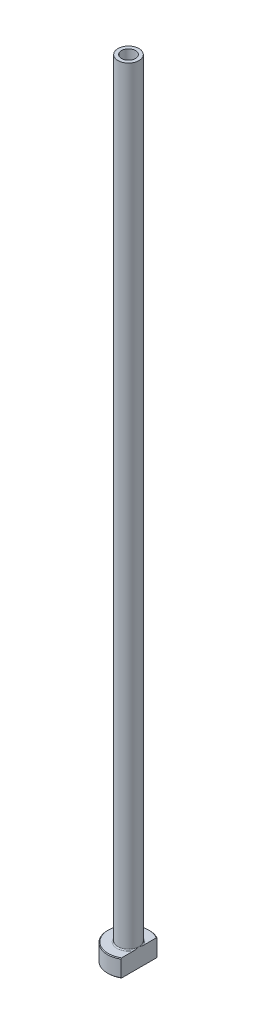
from build123d import *

# Parameters (mm, degrees)
FILLET1_R          = 0.3
CHAMFER1_SIZE      = 0.2
CUT_EXTRUDE1_DEPTH = 226.159943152
CHAMFER2_SIZE      = 0.5


with BuildPart() as part:
    # Sketch1 → Revolve1 (revolve)
    with BuildSketch(Plane.XY, mode=Mode.PRIVATE) as revolve1_sk:
        Polygon((-2, 225), (-3, 225), (-3, 5), (-6, 5), (-6, 0), (-2.25, 0), (-2.25, 168), (-2, 180), align=None)
    revolve(revolve1_sk.sketch.rotate(Axis((0, 92.187680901, 0), (0, -1, 0)), 270), axis=Axis((0, 92.187680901, 0), (0, -1, 0)))

    # Fillet1
    fillet1_edges = [part.edges().sort_by_distance(p)[0] for p in [
        (0, 5, -3),
    ]]
    fillet(fillet1_edges, radius=FILLET1_R)

    # Chamfer1
    chamfer1_edges = [part.edges().sort_by_distance(p)[0] for p in [
        (0, 0, -6),
        (0, 5, -6),
    ]]
    chamfer(chamfer1_edges, length=CHAMFER1_SIZE)

    # Sketch2 → Cut-Extrude1 (cut, through all)
    with BuildSketch(Plane.XZ):
        with BuildLine():
            Line((3, 5.196152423), (3, -5.196152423))
            ThreePointArc((3, -5.196152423), (6, 0), (3, 5.196152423))
        make_face()
    extrude(amount=-CUT_EXTRUDE1_DEPTH, mode=Mode.SUBTRACT)

    # Chamfer2
    chamfer2_edges = [part.edges().sort_by_distance(p)[0] for p in [
        (0, 0, -2.25),
    ]]
    chamfer(chamfer2_edges, length=CHAMFER2_SIZE)


solid = part.part
